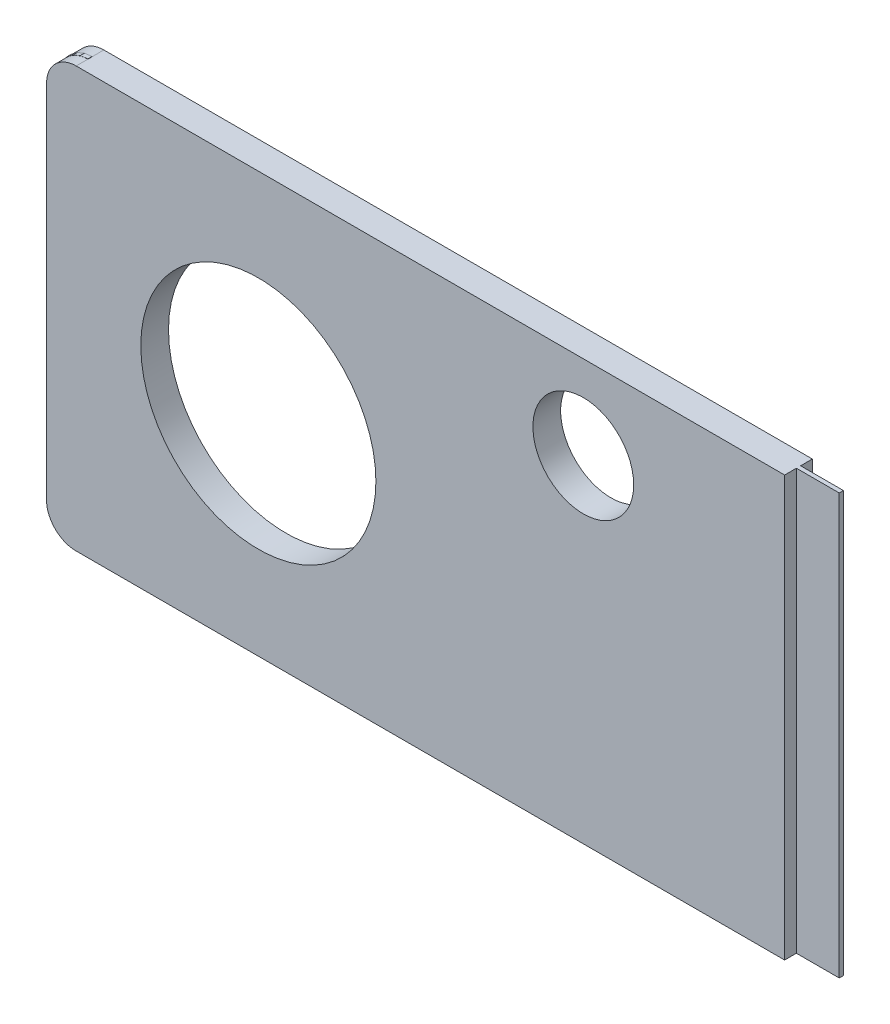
ISO-10303-21;
HEADER;
FILE_DESCRIPTION(('STEP AP214'),'2;1');
FILE_NAME('part.step','',(''),(''),'','','');
FILE_SCHEMA(('AUTOMOTIVE_DESIGN { 1 0 10303 214 1 1 1 1 }'));
ENDSEC;
DATA;
#1=APPLICATION_CONTEXT('core data for automotive mechanical design processes');
#2=APPLICATION_PROTOCOL_DEFINITION('international standard','automotive_design',2000,#1);
#3=PRODUCT_CONTEXT('',#1,'mechanical');
#4=PRODUCT('Part','Part','',(#3));
#5=PRODUCT_RELATED_PRODUCT_CATEGORY('part','',(#4));
#6=PRODUCT_DEFINITION_FORMATION('','',#4);
#7=PRODUCT_DEFINITION_CONTEXT('part definition',#1,'design');
#8=PRODUCT_DEFINITION('design','',#6,#7);
#9=PRODUCT_DEFINITION_SHAPE('','',#8);
#10=(LENGTH_UNIT() NAMED_UNIT(*) SI_UNIT(.MILLI.,.METRE.));
#11=(NAMED_UNIT(*) PLANE_ANGLE_UNIT() SI_UNIT($,.RADIAN.));
#12=(NAMED_UNIT(*) SI_UNIT($,.STERADIAN.) SOLID_ANGLE_UNIT());
#13=UNCERTAINTY_MEASURE_WITH_UNIT(LENGTH_MEASURE(1.E-05),#10,'distance_accuracy_value','');
#14=(GEOMETRIC_REPRESENTATION_CONTEXT(3) GLOBAL_UNCERTAINTY_ASSIGNED_CONTEXT((#13)) GLOBAL_UNIT_ASSIGNED_CONTEXT((#10,
#11,#12)) REPRESENTATION_CONTEXT('',''));
#15=CARTESIAN_POINT('',(0.,0.,0.));
#16=DIRECTION('',(0.,0.,1.));
#17=DIRECTION('',(1.,0.,0.));
#18=AXIS2_PLACEMENT_3D('',#15,#16,#17);
#19=CARTESIAN_POINT('',(0.,0.,0.391160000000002));
#20=DIRECTION('',(0.,0.,1.));
#21=DIRECTION('',(1.,0.,0.));
#22=AXIS2_PLACEMENT_3D('',#19,#20,#21);
#23=PLANE('',#22);
#24=DIRECTION('',(1.,0.,0.));
#25=VECTOR('',#24,1.);
#26=CARTESIAN_POINT('',(156.337000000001,251.477947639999,0.39115999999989));
#27=LINE('',#26,#25);
#28=CARTESIAN_POINT('',(177.794875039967,251.47794764,0.391159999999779));
#29=VERTEX_POINT('',#28);
#30=CARTESIAN_POINT('',(179.090275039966,251.477947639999,0.391159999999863));
#31=VERTEX_POINT('',#30);
#32=EDGE_CURVE('E459',#29,#31,#27,.T.);
#33=ORIENTED_EDGE('',*,*,#32,.T.);
#34=DIRECTION('',(0.,1.,0.));
#35=VECTOR('',#34,1.);
#36=CARTESIAN_POINT('',(179.090275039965,0.,0.391159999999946));
#37=LINE('',#36,#35);
#38=CARTESIAN_POINT('',(179.090275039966,264.185400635,0.391159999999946));
#39=VERTEX_POINT('',#38);
#40=EDGE_CURVE('E104',#31,#39,#37,.T.);
#41=ORIENTED_EDGE('',*,*,#40,.T.);
#42=DIRECTION('',(-1.,0.,0.));
#43=VECTOR('',#42,1.);
#44=CARTESIAN_POINT('',(271.018000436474,264.185400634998,0.39115999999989));
#45=LINE('',#44,#43);
#46=CARTESIAN_POINT('',(177.794875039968,264.185402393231,0.391159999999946));
#47=VERTEX_POINT('',#46);
#48=EDGE_CURVE('E462',#39,#47,#45,.T.);
#49=ORIENTED_EDGE('',*,*,#48,.T.);
#50=DIRECTION('',(0.,-1.,0.));
#51=VECTOR('',#50,1.);
#52=CARTESIAN_POINT('',(177.794875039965,-8.88178419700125E-13,0.391160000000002));
#53=LINE('',#52,#51);
#54=EDGE_CURVE('E387',#47,#29,#53,.T.);
#55=ORIENTED_EDGE('',*,*,#54,.T.);
#56=EDGE_LOOP('',(#33,#41,#49,#55));
#57=FACE_BOUND('',#56,.T.);
#58=ADVANCED_FACE('F89',(#57),#23,.T.);
#59=CARTESIAN_POINT('',(0.,0.,0.264159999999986));
#60=DIRECTION('',(0.,0.,1.));
#61=DIRECTION('',(1.,0.,0.));
#62=AXIS2_PLACEMENT_3D('',#59,#60,#61);
#63=PLANE('',#62);
#64=DIRECTION('',(0.,1.,0.));
#65=VECTOR('',#64,1.);
#66=CARTESIAN_POINT('',(179.090275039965,0.,0.26415999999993));
#67=LINE('',#66,#65);
#68=CARTESIAN_POINT('',(179.090275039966,251.477947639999,0.264159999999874));
#69=VERTEX_POINT('',#68);
#70=CARTESIAN_POINT('',(179.090275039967,264.185400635,0.264159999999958));
#71=VERTEX_POINT('',#70);
#72=EDGE_CURVE('E824',#69,#71,#67,.T.);
#73=ORIENTED_EDGE('',*,*,#72,.F.);
#74=DIRECTION('',(1.,0.,0.));
#75=VECTOR('',#74,1.);
#76=CARTESIAN_POINT('',(156.337000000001,251.477947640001,0.264159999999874));
#77=LINE('',#76,#75);
#78=CARTESIAN_POINT('',(177.794875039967,251.47794764,0.264159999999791));
#79=VERTEX_POINT('',#78);
#80=EDGE_CURVE('E408',#79,#69,#77,.T.);
#81=ORIENTED_EDGE('',*,*,#80,.F.);
#82=DIRECTION('',(0.,-1.,0.));
#83=VECTOR('',#82,1.);
#84=CARTESIAN_POINT('',(177.794875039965,-8.88178419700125E-13,0.264159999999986));
#85=LINE('',#84,#83);
#86=CARTESIAN_POINT('',(177.794875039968,264.185402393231,0.26415999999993));
#87=VERTEX_POINT('',#86);
#88=EDGE_CURVE('E539',#87,#79,#85,.T.);
#89=ORIENTED_EDGE('',*,*,#88,.F.);
#90=DIRECTION('',(-1.,0.,0.));
#91=VECTOR('',#90,1.);
#92=CARTESIAN_POINT('',(271.018000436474,264.185400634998,0.264159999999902));
#93=LINE('',#92,#91);
#94=EDGE_CURVE('E411',#71,#87,#93,.T.);
#95=ORIENTED_EDGE('',*,*,#94,.F.);
#96=EDGE_LOOP('',(#73,#81,#89,#95));
#97=FACE_BOUND('',#96,.T.);
#98=ADVANCED_FACE('F574',(#97),#63,.F.);
#99=CARTESIAN_POINT('',(271.018000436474,264.185400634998,0.264159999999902));
#100=DIRECTION('',(0.,1.,0.));
#101=DIRECTION('',(-1.,0.,0.));
#102=AXIS2_PLACEMENT_3D('',#99,#100,#101);
#103=PLANE('',#102);
#104=ORIENTED_EDGE('',*,*,#48,.F.);
#105=DIRECTION('',(0.,0.,-1.));
#106=VECTOR('',#105,1.);
#107=CARTESIAN_POINT('',(179.090275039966,264.185400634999,0.264159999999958));
#108=LINE('',#107,#106);
#109=EDGE_CURVE('E793',#39,#71,#108,.T.);
#110=ORIENTED_EDGE('',*,*,#109,.T.);
#111=ORIENTED_EDGE('',*,*,#94,.T.);
#112=DIRECTION('',(0.,0.,1.));
#113=VECTOR('',#112,1.);
#114=CARTESIAN_POINT('',(177.794875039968,264.185402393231,-0.0914400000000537));
#115=LINE('',#114,#113);
#116=CARTESIAN_POINT('',(177.794875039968,264.185402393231,-0.0914400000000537));
#117=VERTEX_POINT('',#116);
#118=EDGE_CURVE('E362',#117,#87,#115,.T.);
#119=ORIENTED_EDGE('',*,*,#118,.F.);
#120=DIRECTION('',(-0.999999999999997,-8.20358669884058E-08,0.));
#121=VECTOR('',#120,1.);
#122=CARTESIAN_POINT('',(-2.16726778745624E-05,264.185387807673,-0.0914400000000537));
#123=LINE('',#122,#121);
#124=CARTESIAN_POINT('',(156.362400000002,264.185400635,-0.0914400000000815));
#125=VERTEX_POINT('',#124);
#126=EDGE_CURVE('E672',#117,#125,#123,.T.);
#127=ORIENTED_EDGE('',*,*,#126,.T.);
#128=DIRECTION('',(0.,0.,1.));
#129=VECTOR('',#128,1.);
#130=CARTESIAN_POINT('',(156.362400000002,264.185400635,-0.0914400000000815));
#131=LINE('',#130,#129);
#132=CARTESIAN_POINT('',(156.362400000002,264.185400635,0.264159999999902));
#133=VERTEX_POINT('',#132);
#134=EDGE_CURVE('E351',#125,#133,#131,.T.);
#135=ORIENTED_EDGE('',*,*,#134,.T.);
#136=DIRECTION('',(0.,0.,1.));
#137=VECTOR('',#136,1.);
#138=CARTESIAN_POINT('',(156.362400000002,264.185400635,0.264159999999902));
#139=LINE('',#138,#137);
#140=CARTESIAN_POINT('',(156.362400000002,264.185400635,0.391159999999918));
#141=VERTEX_POINT('',#140);
#142=EDGE_CURVE('E528',#133,#141,#139,.T.);
#143=ORIENTED_EDGE('',*,*,#142,.T.);
#144=CARTESIAN_POINT('',(156.362400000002,264.185400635,0.746759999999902));
#145=VERTEX_POINT('',#144);
#146=EDGE_CURVE('E356',#141,#145,#131,.T.);
#147=ORIENTED_EDGE('',*,*,#146,.T.);
#148=DIRECTION('',(-0.999999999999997,-8.20358669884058E-08,0.));
#149=VECTOR('',#148,1.);
#150=CARTESIAN_POINT('',(-2.16726778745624E-05,264.185387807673,0.746759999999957));
#151=LINE('',#150,#149);
#152=CARTESIAN_POINT('',(177.794875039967,264.185402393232,0.74675999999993));
#153=VERTEX_POINT('',#152);
#154=EDGE_CURVE('E804',#153,#145,#151,.T.);
#155=ORIENTED_EDGE('',*,*,#154,.F.);
#156=EDGE_CURVE('E365',#47,#153,#115,.T.);
#157=ORIENTED_EDGE('',*,*,#156,.F.);
#158=EDGE_LOOP('',(#104,#110,#111,#119,#127,#135,#143,#147,#155,#157));
#159=FACE_BOUND('',#158,.T.);
#160=ADVANCED_FACE('F589',(#159),#103,.T.);
#161=CARTESIAN_POINT('',(156.337000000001,251.477947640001,0.264159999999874));
#162=DIRECTION('',(0.,-1.,0.));
#163=DIRECTION('',(0.,0.,-1.));
#164=AXIS2_PLACEMENT_3D('',#161,#162,#163);
#165=PLANE('',#164);
#166=ORIENTED_EDGE('',*,*,#80,.T.);
#167=DIRECTION('',(0.,0.,1.));
#168=VECTOR('',#167,1.);
#169=CARTESIAN_POINT('',(179.090275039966,251.477947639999,0.264159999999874));
#170=LINE('',#169,#168);
#171=EDGE_CURVE('E13',#69,#31,#170,.T.);
#172=ORIENTED_EDGE('',*,*,#171,.T.);
#173=ORIENTED_EDGE('',*,*,#32,.F.);
#174=DIRECTION('',(0.,0.,1.));
#175=VECTOR('',#174,1.);
#176=CARTESIAN_POINT('',(177.794875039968,251.477947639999,-0.0914400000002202));
#177=LINE('',#176,#175);
#178=CARTESIAN_POINT('',(177.794875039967,251.47794764,0.746759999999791));
#179=VERTEX_POINT('',#178);
#180=EDGE_CURVE('E368',#29,#179,#177,.T.);
#181=ORIENTED_EDGE('',*,*,#180,.T.);
#182=DIRECTION('',(-1.,0.,0.));
#183=VECTOR('',#182,1.);
#184=CARTESIAN_POINT('',(-8.88178419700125E-13,251.47794764,0.746759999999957));
#185=LINE('',#184,#183);
#186=CARTESIAN_POINT('',(156.337000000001,251.477947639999,0.746759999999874));
#187=VERTEX_POINT('',#186);
#188=EDGE_CURVE('E798',#179,#187,#185,.T.);
#189=ORIENTED_EDGE('',*,*,#188,.T.);
#190=DIRECTION('',(0.,0.,1.));
#191=VECTOR('',#190,1.);
#192=CARTESIAN_POINT('',(156.337000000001,251.477947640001,0.264159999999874));
#193=LINE('',#192,#191);
#194=CARTESIAN_POINT('',(156.337000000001,251.477947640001,-0.0914400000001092));
#195=VERTEX_POINT('',#194);
#196=EDGE_CURVE('E531',#195,#187,#193,.T.);
#197=ORIENTED_EDGE('',*,*,#196,.F.);
#198=DIRECTION('',(-1.,0.,0.));
#199=VECTOR('',#198,1.);
#200=CARTESIAN_POINT('',(-8.88178419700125E-13,251.47794764,-0.0914400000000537));
#201=LINE('',#200,#199);
#202=CARTESIAN_POINT('',(177.794875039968,251.477947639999,-0.0914400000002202));
#203=VERTEX_POINT('',#202);
#204=EDGE_CURVE('E662',#203,#195,#201,.T.);
#205=ORIENTED_EDGE('',*,*,#204,.F.);
#206=EDGE_CURVE('E366',#203,#79,#177,.T.);
#207=ORIENTED_EDGE('',*,*,#206,.T.);
#208=EDGE_LOOP('',(#166,#172,#173,#181,#189,#197,#205,#207));
#209=FACE_BOUND('',#208,.T.);
#210=ADVANCED_FACE('F708',(#209),#165,.T.);
#211=DIRECTION('',(0.,-1.,0.));
#212=VECTOR('',#211,1.);
#213=CARTESIAN_POINT('',(155.468275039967,0.,0.264160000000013));
#214=LINE('',#213,#212);
#215=CARTESIAN_POINT('',(155.468275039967,263.315739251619,0.264159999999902));
#216=VERTEX_POINT('',#215);
#217=CARTESIAN_POINT('',(155.468275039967,263.31369636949,0.264159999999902));
#218=VERTEX_POINT('',#217);
#219=EDGE_CURVE('E827',#216,#218,#214,.T.);
#220=ORIENTED_EDGE('',*,*,#219,.F.);
#221=DIRECTION('',(-0.130527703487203,-0.991444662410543,0.));
#222=VECTOR('',#221,1.);
#223=CARTESIAN_POINT('',(155.496282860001,263.528477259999,0.264159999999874));
#224=LINE('',#223,#222);
#225=CARTESIAN_POINT('',(155.468364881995,263.31642166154,0.264159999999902));
#226=VERTEX_POINT('',#225);
#227=EDGE_CURVE('E433',#226,#216,#224,.T.);
#228=ORIENTED_EDGE('',*,*,#227,.F.);
#229=CARTESIAN_POINT('',(156.367842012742,263.285405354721,0.264159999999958));
#230=DIRECTION('',(0.,0.,1.));
#231=DIRECTION('',(1.,0.,0.));
#232=AXIS2_PLACEMENT_3D('',#229,#230,#231);
#233=CIRCLE('',#232,0.900011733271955);
#234=EDGE_CURVE('E97',#218,#226,#233,.F.);
#235=ORIENTED_EDGE('',*,*,#234,.F.);
#236=EDGE_LOOP('',(#220,#228,#235));
#237=FACE_BOUND('',#236,.T.);
#238=ADVANCED_FACE('F591',(#237),#63,.F.);
#239=CARTESIAN_POINT('',(155.496282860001,263.528477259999,0.264159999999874));
#240=DIRECTION('',(-0.991444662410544,0.130527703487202,0.));
#241=DIRECTION('',(-0.130527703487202,-0.991444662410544,0.));
#242=AXIS2_PLACEMENT_3D('',#239,#240,#241);
#243=PLANE('',#242);
#244=ORIENTED_EDGE('',*,*,#227,.T.);
#245=DIRECTION('',(0.,0.,1.));
#246=VECTOR('',#245,1.);
#247=CARTESIAN_POINT('',(155.468275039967,263.315739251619,0.264159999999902));
#248=LINE('',#247,#246);
#249=CARTESIAN_POINT('',(155.468275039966,263.31573925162,0.391159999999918));
#250=VERTEX_POINT('',#249);
#251=EDGE_CURVE('E331',#216,#250,#248,.T.);
#252=ORIENTED_EDGE('',*,*,#251,.T.);
#253=DIRECTION('',(-0.130527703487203,-0.991444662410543,0.));
#254=VECTOR('',#253,1.);
#255=CARTESIAN_POINT('',(155.496282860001,263.528477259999,0.39115999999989));
#256=LINE('',#255,#254);
#257=CARTESIAN_POINT('',(155.468364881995,263.31642166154,0.391159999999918));
#258=VERTEX_POINT('',#257);
#259=EDGE_CURVE('E327',#258,#250,#256,.T.);
#260=ORIENTED_EDGE('',*,*,#259,.F.);
#261=DIRECTION('',(0.,0.,1.));
#262=VECTOR('',#261,1.);
#263=CARTESIAN_POINT('',(155.468364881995,263.31642166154,-0.0914400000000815));
#264=LINE('',#263,#262);
#265=EDGE_CURVE('E342',#258,#226,#264,.F.);
#266=ORIENTED_EDGE('',*,*,#265,.T.);
#267=EDGE_LOOP('',(#244,#252,#260,#266));
#268=FACE_BOUND('',#267,.T.);
#269=ADVANCED_FACE('F577',(#268),#243,.T.);
#270=ORIENTED_EDGE('',*,*,#259,.T.);
#271=DIRECTION('',(0.,-1.,0.));
#272=VECTOR('',#271,1.);
#273=CARTESIAN_POINT('',(155.468275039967,0.,0.391160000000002));
#274=LINE('',#273,#272);
#275=CARTESIAN_POINT('',(155.468275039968,263.313696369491,0.391159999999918));
#276=VERTEX_POINT('',#275);
#277=EDGE_CURVE('E325',#250,#276,#274,.T.);
#278=ORIENTED_EDGE('',*,*,#277,.T.);
#279=CARTESIAN_POINT('',(156.367842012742,263.285405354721,0.391159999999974));
#280=DIRECTION('',(0.,0.,1.));
#281=DIRECTION('',(1.,0.,0.));
#282=AXIS2_PLACEMENT_3D('',#279,#280,#281);
#283=CIRCLE('',#282,0.900011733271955);
#284=EDGE_CURVE('E111',#276,#258,#283,.F.);
#285=ORIENTED_EDGE('',*,*,#284,.T.);
#286=EDGE_LOOP('',(#270,#278,#285));
#287=FACE_BOUND('',#286,.T.);
#288=ADVANCED_FACE('F326',(#287),#23,.T.);
#289=DIRECTION('',(-0.382683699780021,-0.92387942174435,0.));
#290=VECTOR('',#289,1.);
#291=CARTESIAN_POINT('',(155.58586104,263.744737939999,0.391159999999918));
#292=LINE('',#291,#290);
#293=CARTESIAN_POINT('',(155.58586104,263.744737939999,0.391159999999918));
#294=VERTEX_POINT('',#293);
#295=CARTESIAN_POINT('',(155.559610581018,263.681363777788,0.391159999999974));
#296=VERTEX_POINT('',#295);
#297=EDGE_CURVE('E481',#294,#296,#292,.T.);
#298=ORIENTED_EDGE('',*,*,#297,.T.);
#299=CARTESIAN_POINT('',(155.653811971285,263.833294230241,0.391159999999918));
#300=VERTEX_POINT('',#299);
#301=EDGE_CURVE('E392',#296,#300,#283,.F.);
#302=ORIENTED_EDGE('',*,*,#301,.T.);
#303=DIRECTION('',(-0.608757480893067,-0.79335636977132,0.));
#304=VECTOR('',#303,1.);
#305=CARTESIAN_POINT('',(155.72835758,263.930444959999,0.391159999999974));
#306=LINE('',#305,#304);
#307=EDGE_CURVE('E476',#300,#294,#306,.T.);
#308=ORIENTED_EDGE('',*,*,#307,.T.);
#309=EDGE_LOOP('',(#298,#302,#308));
#310=FACE_BOUND('',#309,.T.);
#311=ADVANCED_FACE('F566',(#310),#23,.T.);
#312=CARTESIAN_POINT('',(155.72835758,263.930444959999,0.391159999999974));
#313=VERTEX_POINT('',#312);
#314=EDGE_CURVE('E477',#313,#300,#306,.T.);
#315=ORIENTED_EDGE('',*,*,#314,.T.);
#316=EDGE_CURVE('E343',#300,#141,#283,.F.);
#317=ORIENTED_EDGE('',*,*,#316,.T.);
#318=DIRECTION('',(0.,1.,0.));
#319=VECTOR('',#318,1.);
#320=CARTESIAN_POINT('',(156.362400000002,264.185400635,0.391159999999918));
#321=LINE('',#320,#319);
#322=CARTESIAN_POINT('',(156.3624,264.19307334,0.391159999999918));
#323=VERTEX_POINT('',#322);
#324=EDGE_CURVE('E464',#141,#323,#321,.T.);
#325=ORIENTED_EDGE('',*,*,#324,.T.);
#326=DIRECTION('',(-0.991444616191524,-0.130528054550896,0.));
#327=VECTOR('',#326,1.);
#328=CARTESIAN_POINT('',(156.3624,264.19307334,0.391159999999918));
#329=LINE('',#328,#327);
#330=CARTESIAN_POINT('',(156.130325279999,264.16251968,0.391159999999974));
#331=VERTEX_POINT('',#330);
#332=EDGE_CURVE('E467',#323,#331,#329,.T.);
#333=ORIENTED_EDGE('',*,*,#332,.T.);
#334=DIRECTION('',(-0.923879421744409,-0.382683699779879,0.));
#335=VECTOR('',#334,1.);
#336=CARTESIAN_POINT('',(156.130325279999,264.16251968,0.391159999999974));
#337=LINE('',#336,#335);
#338=CARTESIAN_POINT('',(155.914064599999,264.072941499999,0.391160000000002));
#339=VERTEX_POINT('',#338);
#340=EDGE_CURVE('E470',#331,#339,#337,.T.);
#341=ORIENTED_EDGE('',*,*,#340,.T.);
#342=DIRECTION('',(-0.793356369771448,-0.6087574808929,0.));
#343=VECTOR('',#342,1.);
#344=CARTESIAN_POINT('',(155.914064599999,264.072941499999,0.391160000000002));
#345=LINE('',#344,#343);
#346=EDGE_CURVE('E473',#339,#313,#345,.T.);
#347=ORIENTED_EDGE('',*,*,#346,.T.);
#348=EDGE_LOOP('',(#315,#317,#325,#333,#341,#347));
#349=FACE_BOUND('',#348,.T.);
#350=ADVANCED_FACE('F581',(#349),#23,.T.);
#351=CARTESIAN_POINT('',(155.58586104,263.744737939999,0.264159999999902));
#352=DIRECTION('',(-0.92387942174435,0.382683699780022,0.));
#353=DIRECTION('',(-0.382683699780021,-0.92387942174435,0.));
#354=AXIS2_PLACEMENT_3D('',#351,#352,#353);
#355=PLANE('',#354);
#356=DIRECTION('',(-0.382683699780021,-0.92387942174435,0.));
#357=VECTOR('',#356,1.);
#358=CARTESIAN_POINT('',(155.58586104,263.744737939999,0.264159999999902));
#359=LINE('',#358,#357);
#360=CARTESIAN_POINT('',(155.58586104,263.744737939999,0.264159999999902));
#361=VERTEX_POINT('',#360);
#362=CARTESIAN_POINT('',(155.559610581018,263.681363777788,0.264159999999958));
#363=VERTEX_POINT('',#362);
#364=EDGE_CURVE('E430',#361,#363,#359,.T.);
#365=ORIENTED_EDGE('',*,*,#364,.T.);
#366=DIRECTION('',(0.,0.,1.));
#367=VECTOR('',#366,1.);
#368=CARTESIAN_POINT('',(155.559610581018,263.681363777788,-0.0914400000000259));
#369=LINE('',#368,#367);
#370=EDGE_CURVE('E390',#363,#296,#369,.T.);
#371=ORIENTED_EDGE('',*,*,#370,.T.);
#372=ORIENTED_EDGE('',*,*,#297,.F.);
#373=DIRECTION('',(0.,0.,1.));
#374=VECTOR('',#373,1.);
#375=CARTESIAN_POINT('',(155.58586104,263.744737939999,0.264159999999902));
#376=LINE('',#375,#374);
#377=EDGE_CURVE('E517',#361,#294,#376,.T.);
#378=ORIENTED_EDGE('',*,*,#377,.F.);
#379=EDGE_LOOP('',(#365,#371,#372,#378));
#380=FACE_BOUND('',#379,.T.);
#381=ADVANCED_FACE('F732',(#380),#355,.T.);
#382=CARTESIAN_POINT('',(155.653811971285,263.833294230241,0.264159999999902));
#383=VERTEX_POINT('',#382);
#384=EDGE_CURVE('E542',#363,#383,#233,.F.);
#385=ORIENTED_EDGE('',*,*,#384,.F.);
#386=ORIENTED_EDGE('',*,*,#364,.F.);
#387=DIRECTION('',(-0.608757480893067,-0.79335636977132,0.));
#388=VECTOR('',#387,1.);
#389=CARTESIAN_POINT('',(155.72835758,263.930444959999,0.264159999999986));
#390=LINE('',#389,#388);
#391=EDGE_CURVE('E425',#383,#361,#390,.T.);
#392=ORIENTED_EDGE('',*,*,#391,.F.);
#393=EDGE_LOOP('',(#385,#386,#392));
#394=FACE_BOUND('',#393,.T.);
#395=ADVANCED_FACE('F781',(#394),#63,.F.);
#396=EDGE_CURVE('E541',#383,#133,#233,.F.);
#397=ORIENTED_EDGE('',*,*,#396,.F.);
#398=CARTESIAN_POINT('',(155.72835758,263.930444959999,0.264159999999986));
#399=VERTEX_POINT('',#398);
#400=EDGE_CURVE('E426',#399,#383,#390,.T.);
#401=ORIENTED_EDGE('',*,*,#400,.F.);
#402=DIRECTION('',(-0.793356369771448,-0.6087574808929,0.));
#403=VECTOR('',#402,1.);
#404=CARTESIAN_POINT('',(155.914064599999,264.072941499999,0.264159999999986));
#405=LINE('',#404,#403);
#406=CARTESIAN_POINT('',(155.914064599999,264.072941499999,0.264159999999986));
#407=VERTEX_POINT('',#406);
#408=EDGE_CURVE('E422',#407,#399,#405,.T.);
#409=ORIENTED_EDGE('',*,*,#408,.F.);
#410=DIRECTION('',(-0.923879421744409,-0.382683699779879,0.));
#411=VECTOR('',#410,1.);
#412=CARTESIAN_POINT('',(156.130325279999,264.16251968,0.264159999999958));
#413=LINE('',#412,#411);
#414=CARTESIAN_POINT('',(156.130325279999,264.16251968,0.264159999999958));
#415=VERTEX_POINT('',#414);
#416=EDGE_CURVE('E419',#415,#407,#413,.T.);
#417=ORIENTED_EDGE('',*,*,#416,.F.);
#418=DIRECTION('',(-0.991444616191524,-0.130528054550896,0.));
#419=VECTOR('',#418,1.);
#420=CARTESIAN_POINT('',(156.3624,264.19307334,0.264159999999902));
#421=LINE('',#420,#419);
#422=CARTESIAN_POINT('',(156.3624,264.19307334,0.264159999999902));
#423=VERTEX_POINT('',#422);
#424=EDGE_CURVE('E416',#423,#415,#421,.T.);
#425=ORIENTED_EDGE('',*,*,#424,.F.);
#426=DIRECTION('',(0.,1.,0.));
#427=VECTOR('',#426,1.);
#428=CARTESIAN_POINT('',(156.362400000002,264.185400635,0.264159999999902));
#429=LINE('',#428,#427);
#430=EDGE_CURVE('E413',#133,#423,#429,.T.);
#431=ORIENTED_EDGE('',*,*,#430,.F.);
#432=EDGE_LOOP('',(#397,#401,#409,#417,#425,#431));
#433=FACE_BOUND('',#432,.T.);
#434=ADVANCED_FACE('F685',(#433),#63,.F.);
#435=CARTESIAN_POINT('',(155.72835758,263.930444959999,0.264159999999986));
#436=DIRECTION('',(-0.79335636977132,0.608757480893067,0.));
#437=DIRECTION('',(-0.608757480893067,-0.79335636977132,0.));
#438=AXIS2_PLACEMENT_3D('',#435,#436,#437);
#439=PLANE('',#438);
#440=ORIENTED_EDGE('',*,*,#400,.T.);
#441=ORIENTED_EDGE('',*,*,#391,.T.);
#442=ORIENTED_EDGE('',*,*,#377,.T.);
#443=ORIENTED_EDGE('',*,*,#307,.F.);
#444=ORIENTED_EDGE('',*,*,#314,.F.);
#445=DIRECTION('',(0.,0.,1.));
#446=VECTOR('',#445,1.);
#447=CARTESIAN_POINT('',(155.72835758,263.930444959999,0.264159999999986));
#448=LINE('',#447,#446);
#449=EDGE_CURVE('E520',#399,#313,#448,.T.);
#450=ORIENTED_EDGE('',*,*,#449,.F.);
#451=EDGE_LOOP('',(#440,#441,#442,#443,#444,#450));
#452=FACE_BOUND('',#451,.T.);
#453=ADVANCED_FACE('F726',(#452),#439,.T.);
#454=CARTESIAN_POINT('',(155.914064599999,264.072941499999,0.264159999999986));
#455=DIRECTION('',(-0.6087574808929,0.793356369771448,0.));
#456=DIRECTION('',(-0.793356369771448,-0.6087574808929,0.));
#457=AXIS2_PLACEMENT_3D('',#454,#455,#456);
#458=PLANE('',#457);
#459=ORIENTED_EDGE('',*,*,#346,.F.);
#460=DIRECTION('',(0.,0.,1.));
#461=VECTOR('',#460,1.);
#462=CARTESIAN_POINT('',(155.914064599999,264.072941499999,0.264159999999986));
#463=LINE('',#462,#461);
#464=EDGE_CURVE('E522',#407,#339,#463,.T.);
#465=ORIENTED_EDGE('',*,*,#464,.F.);
#466=ORIENTED_EDGE('',*,*,#408,.T.);
#467=ORIENTED_EDGE('',*,*,#449,.T.);
#468=EDGE_LOOP('',(#459,#465,#466,#467));
#469=FACE_BOUND('',#468,.T.);
#470=ADVANCED_FACE('F722',(#469),#458,.T.);
#471=CARTESIAN_POINT('',(156.130325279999,264.16251968,0.264159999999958));
#472=DIRECTION('',(-0.382683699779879,0.92387942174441,0.));
#473=DIRECTION('',(-0.92387942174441,-0.382683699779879,0.));
#474=AXIS2_PLACEMENT_3D('',#471,#472,#473);
#475=PLANE('',#474);
#476=ORIENTED_EDGE('',*,*,#340,.F.);
#477=DIRECTION('',(0.,0.,1.));
#478=VECTOR('',#477,1.);
#479=CARTESIAN_POINT('',(156.130325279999,264.16251968,0.264159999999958));
#480=LINE('',#479,#478);
#481=EDGE_CURVE('E524',#415,#331,#480,.T.);
#482=ORIENTED_EDGE('',*,*,#481,.F.);
#483=ORIENTED_EDGE('',*,*,#416,.T.);
#484=ORIENTED_EDGE('',*,*,#464,.T.);
#485=EDGE_LOOP('',(#476,#482,#483,#484));
#486=FACE_BOUND('',#485,.T.);
#487=ADVANCED_FACE('F719',(#486),#475,.T.);
#488=CARTESIAN_POINT('',(156.3624,264.19307334,0.264159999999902));
#489=DIRECTION('',(-0.130528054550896,0.991444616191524,0.));
#490=DIRECTION('',(-0.991444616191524,-0.130528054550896,0.));
#491=AXIS2_PLACEMENT_3D('',#488,#489,#490);
#492=PLANE('',#491);
#493=ORIENTED_EDGE('',*,*,#332,.F.);
#494=DIRECTION('',(0.,0.,1.));
#495=VECTOR('',#494,1.);
#496=CARTESIAN_POINT('',(156.3624,264.19307334,0.264159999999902));
#497=LINE('',#496,#495);
#498=EDGE_CURVE('E526',#423,#323,#497,.T.);
#499=ORIENTED_EDGE('',*,*,#498,.F.);
#500=ORIENTED_EDGE('',*,*,#424,.T.);
#501=ORIENTED_EDGE('',*,*,#481,.T.);
#502=EDGE_LOOP('',(#493,#499,#500,#501));
#503=FACE_BOUND('',#502,.T.);
#504=ADVANCED_FACE('F692',(#503),#492,.T.);
#505=CARTESIAN_POINT('',(156.362400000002,264.185400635,0.264159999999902));
#506=DIRECTION('',(1.,0.,0.));
#507=DIRECTION('',(0.,0.,-1.));
#508=AXIS2_PLACEMENT_3D('',#505,#506,#507);
#509=PLANE('',#508);
#510=ORIENTED_EDGE('',*,*,#324,.F.);
#511=ORIENTED_EDGE('',*,*,#142,.F.);
#512=ORIENTED_EDGE('',*,*,#430,.T.);
#513=ORIENTED_EDGE('',*,*,#498,.T.);
#514=EDGE_LOOP('',(#510,#511,#512,#513));
#515=FACE_BOUND('',#514,.T.);
#516=ADVANCED_FACE('F682',(#515),#509,.T.);
#517=CARTESIAN_POINT('',(177.794875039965,-8.88178419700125E-13,-0.0914399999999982));
#518=DIRECTION('',(-1.,0.,0.));
#519=DIRECTION('',(0.,0.,1.));
#520=AXIS2_PLACEMENT_3D('',#517,#518,#519);
#521=PLANE('',#520);
#522=ORIENTED_EDGE('',*,*,#118,.T.);
#523=ORIENTED_EDGE('',*,*,#88,.T.);
#524=ORIENTED_EDGE('',*,*,#206,.F.);
#525=DIRECTION('',(0.,-1.,0.));
#526=VECTOR('',#525,1.);
#527=CARTESIAN_POINT('',(177.794875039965,-8.88178419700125E-13,-0.0914399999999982));
#528=LINE('',#527,#526);
#529=EDGE_CURVE('E665',#117,#203,#528,.T.);
#530=ORIENTED_EDGE('',*,*,#529,.F.);
#531=EDGE_LOOP('',(#522,#523,#524,#530));
#532=FACE_BOUND('',#531,.T.);
#533=ADVANCED_FACE('F716',(#532),#521,.F.);
#534=CARTESIAN_POINT('',(155.468275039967,0.,-0.0914399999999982));
#535=DIRECTION('',(-1.,0.,0.));
#536=DIRECTION('',(0.,0.,1.));
#537=AXIS2_PLACEMENT_3D('',#534,#535,#536);
#538=PLANE('',#537);
#539=ORIENTED_EDGE('',*,*,#219,.T.);
#540=DIRECTION('',(0.,0.,1.));
#541=VECTOR('',#540,1.);
#542=CARTESIAN_POINT('',(155.468275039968,263.313696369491,-0.0914400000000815));
#543=LINE('',#542,#541);
#544=CARTESIAN_POINT('',(155.468275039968,263.313696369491,-0.0914400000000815));
#545=VERTEX_POINT('',#544);
#546=EDGE_CURVE('E350',#545,#218,#543,.T.);
#547=ORIENTED_EDGE('',*,*,#546,.F.);
#548=DIRECTION('',(0.,-1.,0.));
#549=VECTOR('',#548,1.);
#550=CARTESIAN_POINT('',(155.468275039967,0.,-0.0914399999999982));
#551=LINE('',#550,#549);
#552=CARTESIAN_POINT('',(155.468275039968,252.300953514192,-0.0914400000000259));
#553=VERTEX_POINT('',#552);
#554=EDGE_CURVE('E663',#545,#553,#551,.T.);
#555=ORIENTED_EDGE('',*,*,#554,.T.);
#556=DIRECTION('',(0.,0.,1.));
#557=VECTOR('',#556,1.);
#558=CARTESIAN_POINT('',(155.468275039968,252.300953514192,-0.0914400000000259));
#559=LINE('',#558,#557);
#560=CARTESIAN_POINT('',(155.468275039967,252.300953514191,0.746759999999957));
#561=VERTEX_POINT('',#560);
#562=EDGE_CURVE('E369',#553,#561,#559,.T.);
#563=ORIENTED_EDGE('',*,*,#562,.T.);
#564=DIRECTION('',(0.,-1.,0.));
#565=VECTOR('',#564,1.);
#566=CARTESIAN_POINT('',(155.468275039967,0.,0.746760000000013));
#567=LINE('',#566,#565);
#568=CARTESIAN_POINT('',(155.468275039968,263.313696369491,0.746759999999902));
#569=VERTEX_POINT('',#568);
#570=EDGE_CURVE('E348',#569,#561,#567,.T.);
#571=ORIENTED_EDGE('',*,*,#570,.F.);
#572=EDGE_CURVE('E338',#276,#569,#543,.T.);
#573=ORIENTED_EDGE('',*,*,#572,.F.);
#574=ORIENTED_EDGE('',*,*,#277,.F.);
#575=ORIENTED_EDGE('',*,*,#251,.F.);
#576=EDGE_LOOP('',(#539,#547,#555,#563,#571,#573,#574,#575));
#577=FACE_BOUND('',#576,.T.);
#578=ADVANCED_FACE('F346',(#577),#538,.T.);
#579=CARTESIAN_POINT('',(156.367842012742,263.285405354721,-0.0914400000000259));
#580=DIRECTION('',(0.,0.,1.));
#581=DIRECTION('',(1.,0.,0.));
#582=AXIS2_PLACEMENT_3D('',#579,#580,#581);
#583=CYLINDRICAL_SURFACE('',#582,0.900011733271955);
#584=ORIENTED_EDGE('',*,*,#316,.F.);
#585=ORIENTED_EDGE('',*,*,#301,.F.);
#586=ORIENTED_EDGE('',*,*,#370,.F.);
#587=ORIENTED_EDGE('',*,*,#384,.T.);
#588=ORIENTED_EDGE('',*,*,#396,.T.);
#589=ORIENTED_EDGE('',*,*,#134,.F.);
#590=CARTESIAN_POINT('',(156.367842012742,263.285405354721,-0.0914400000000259));
#591=DIRECTION('',(0.,0.,1.));
#592=DIRECTION('',(1.,0.,0.));
#593=AXIS2_PLACEMENT_3D('',#590,#591,#592);
#594=CIRCLE('',#593,0.900011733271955);
#595=EDGE_CURVE('E359',#545,#125,#594,.F.);
#596=ORIENTED_EDGE('',*,*,#595,.F.);
#597=ORIENTED_EDGE('',*,*,#546,.T.);
#598=ORIENTED_EDGE('',*,*,#234,.T.);
#599=ORIENTED_EDGE('',*,*,#265,.F.);
#600=ORIENTED_EDGE('',*,*,#284,.F.);
#601=ORIENTED_EDGE('',*,*,#572,.T.);
#602=CARTESIAN_POINT('',(156.367842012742,263.285405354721,0.746759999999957));
#603=DIRECTION('',(0.,0.,1.));
#604=DIRECTION('',(1.,0.,0.));
#605=AXIS2_PLACEMENT_3D('',#602,#603,#604);
#606=CIRCLE('',#605,0.900011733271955);
#607=EDGE_CURVE('E807',#569,#145,#606,.F.);
#608=ORIENTED_EDGE('',*,*,#607,.T.);
#609=ORIENTED_EDGE('',*,*,#146,.F.);
#610=EDGE_LOOP('',(#584,#585,#586,#587,#588,#589,#596,#597,#598,#599,#600,#601,#608,#609));
#611=FACE_BOUND('',#610,.T.);
#612=CARTESIAN_POINT('',(155.490986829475,263.488250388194,0.39115999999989));
#613=VERTEX_POINT('',#612);
#614=CARTESIAN_POINT('',(155.516351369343,263.576926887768,0.391159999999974));
#615=VERTEX_POINT('',#614);
#616=EDGE_CURVE('E345',#613,#615,#283,.F.);
#617=ORIENTED_EDGE('',*,*,#616,.F.);
#618=DIRECTION('',(0.,0.,1.));
#619=VECTOR('',#618,1.);
#620=CARTESIAN_POINT('',(155.490986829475,263.488250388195,-0.0914400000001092));
#621=LINE('',#620,#619);
#622=CARTESIAN_POINT('',(155.490986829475,263.488250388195,0.264159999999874));
#623=VERTEX_POINT('',#622);
#624=EDGE_CURVE('E398',#623,#613,#621,.T.);
#625=ORIENTED_EDGE('',*,*,#624,.F.);
#626=CARTESIAN_POINT('',(155.516351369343,263.576926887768,0.264159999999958));
#627=VERTEX_POINT('',#626);
#628=EDGE_CURVE('E545',#623,#627,#233,.F.);
#629=ORIENTED_EDGE('',*,*,#628,.T.);
#630=DIRECTION('',(0.,0.,1.));
#631=VECTOR('',#630,1.);
#632=CARTESIAN_POINT('',(155.516351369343,263.576926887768,-0.0914400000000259));
#633=LINE('',#632,#631);
#634=EDGE_CURVE('E395',#615,#627,#633,.F.);
#635=ORIENTED_EDGE('',*,*,#634,.F.);
#636=EDGE_LOOP('',(#617,#625,#629,#635));
#637=FACE_BOUND('',#636,.T.);
#638=ADVANCED_FACE('F335',(#611,#637),#583,.T.);
#639=ORIENTED_EDGE('',*,*,#54,.F.);
#640=ORIENTED_EDGE('',*,*,#156,.T.);
#641=DIRECTION('',(0.,-1.,0.));
#642=VECTOR('',#641,1.);
#643=CARTESIAN_POINT('',(177.794875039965,-8.88178419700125E-13,0.746759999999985));
#644=LINE('',#643,#642);
#645=EDGE_CURVE('E801',#153,#179,#644,.T.);
#646=ORIENTED_EDGE('',*,*,#645,.T.);
#647=ORIENTED_EDGE('',*,*,#180,.F.);
#648=EDGE_LOOP('',(#639,#640,#646,#647));
#649=FACE_BOUND('',#648,.T.);
#650=ADVANCED_FACE('F648',(#649),#521,.F.);
#651=CARTESIAN_POINT('',(156.356036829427,252.368036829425,-0.0914400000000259));
#652=DIRECTION('',(0.,0.,1.));
#653=DIRECTION('',(1.,0.,0.));
#654=AXIS2_PLACEMENT_3D('',#651,#652,#653);
#655=CYLINDRICAL_SURFACE('',#654,0.890292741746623);
#656=DIRECTION('',(0.,0.,1.));
#657=VECTOR('',#656,1.);
#658=CARTESIAN_POINT('',(155.491348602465,252.15605702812,-0.0914400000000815));
#659=LINE('',#658,#657);
#660=CARTESIAN_POINT('',(155.491348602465,252.15605702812,0.264159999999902));
#661=VERTEX_POINT('',#660);
#662=CARTESIAN_POINT('',(155.491348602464,252.156057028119,0.391159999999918));
#663=VERTEX_POINT('',#662);
#664=EDGE_CURVE('E382',#661,#663,#659,.T.);
#665=ORIENTED_EDGE('',*,*,#664,.T.);
#666=CARTESIAN_POINT('',(156.356036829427,252.368036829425,0.391159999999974));
#667=DIRECTION('',(0.,0.,1.));
#668=DIRECTION('',(1.,0.,0.));
#669=AXIS2_PLACEMENT_3D('',#666,#667,#668);
#670=CIRCLE('',#669,0.890292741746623);
#671=CARTESIAN_POINT('',(155.513427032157,252.080582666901,0.391159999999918));
#672=VERTEX_POINT('',#671);
#673=EDGE_CURVE('E377',#663,#672,#670,.T.);
#674=ORIENTED_EDGE('',*,*,#673,.T.);
#675=DIRECTION('',(0.,0.,1.));
#676=VECTOR('',#675,1.);
#677=CARTESIAN_POINT('',(155.513427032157,252.080582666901,-0.0914400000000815));
#678=LINE('',#677,#676);
#679=CARTESIAN_POINT('',(155.513427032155,252.080582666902,0.264159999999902));
#680=VERTEX_POINT('',#679);
#681=EDGE_CURVE('E384',#672,#680,#678,.F.);
#682=ORIENTED_EDGE('',*,*,#681,.T.);
#683=CARTESIAN_POINT('',(156.356036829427,252.368036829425,0.264159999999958));
#684=DIRECTION('',(0.,0.,1.));
#685=DIRECTION('',(1.,0.,0.));
#686=AXIS2_PLACEMENT_3D('',#683,#684,#685);
#687=CIRCLE('',#686,0.890292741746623);
#688=EDGE_CURVE('E538',#661,#680,#687,.T.);
#689=ORIENTED_EDGE('',*,*,#688,.F.);
#690=EDGE_LOOP('',(#665,#674,#682,#689));
#691=FACE_BOUND('',#690,.T.);
#692=DIRECTION('',(0.,0.,1.));
#693=VECTOR('',#692,1.);
#694=CARTESIAN_POINT('',(155.556959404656,251.975485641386,-0.0914400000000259));
#695=LINE('',#694,#693);
#696=CARTESIAN_POINT('',(155.556959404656,251.975485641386,0.264159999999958));
#697=VERTEX_POINT('',#696);
#698=CARTESIAN_POINT('',(155.556959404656,251.975485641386,0.391159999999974));
#699=VERTEX_POINT('',#698);
#700=EDGE_CURVE('E376',#697,#699,#695,.T.);
#701=ORIENTED_EDGE('',*,*,#700,.T.);
#702=CARTESIAN_POINT('',(155.649721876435,251.826058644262,0.391159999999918));
#703=VERTEX_POINT('',#702);
#704=EDGE_CURVE('E385',#699,#703,#670,.T.);
#705=ORIENTED_EDGE('',*,*,#704,.T.);
#706=CARTESIAN_POINT('',(155.814058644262,251.661721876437,0.391159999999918));
#707=VERTEX_POINT('',#706);
#708=EDGE_CURVE('E620',#703,#707,#670,.T.);
#709=ORIENTED_EDGE('',*,*,#708,.T.);
#710=CARTESIAN_POINT('',(155.963485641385,251.568959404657,0.391159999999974));
#711=VERTEX_POINT('',#710);
#712=EDGE_CURVE('E378',#707,#711,#670,.T.);
#713=ORIENTED_EDGE('',*,*,#712,.T.);
#714=DIRECTION('',(0.,0.,1.));
#715=VECTOR('',#714,1.);
#716=CARTESIAN_POINT('',(155.963485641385,251.568959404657,-0.0914400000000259));
#717=LINE('',#716,#715);
#718=CARTESIAN_POINT('',(155.963485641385,251.568959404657,0.264159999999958));
#719=VERTEX_POINT('',#718);
#720=EDGE_CURVE('E380',#711,#719,#717,.F.);
#721=ORIENTED_EDGE('',*,*,#720,.T.);
#722=CARTESIAN_POINT('',(155.814058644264,251.661721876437,0.264159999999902));
#723=VERTEX_POINT('',#722);
#724=EDGE_CURVE('E537',#723,#719,#687,.T.);
#725=ORIENTED_EDGE('',*,*,#724,.F.);
#726=CARTESIAN_POINT('',(155.649721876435,251.826058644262,0.264159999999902));
#727=VERTEX_POINT('',#726);
#728=EDGE_CURVE('E635',#727,#723,#687,.T.);
#729=ORIENTED_EDGE('',*,*,#728,.F.);
#730=EDGE_CURVE('E638',#697,#727,#687,.T.);
#731=ORIENTED_EDGE('',*,*,#730,.F.);
#732=EDGE_LOOP('',(#701,#705,#709,#713,#721,#725,#729,#731));
#733=FACE_BOUND('',#732,.T.);
#734=DIRECTION('',(0.,0.,1.));
#735=VECTOR('',#734,1.);
#736=CARTESIAN_POINT('',(156.068582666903,251.525427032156,-0.0914400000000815));
#737=LINE('',#736,#735);
#738=CARTESIAN_POINT('',(156.068582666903,251.525427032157,0.264159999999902));
#739=VERTEX_POINT('',#738);
#740=CARTESIAN_POINT('',(156.068582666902,251.525427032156,0.391159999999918));
#741=VERTEX_POINT('',#740);
#742=EDGE_CURVE('E372',#739,#741,#737,.T.);
#743=ORIENTED_EDGE('',*,*,#742,.T.);
#744=CARTESIAN_POINT('',(156.144057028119,251.503348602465,0.391159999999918));
#745=VERTEX_POINT('',#744);
#746=EDGE_CURVE('E374',#741,#745,#670,.T.);
#747=ORIENTED_EDGE('',*,*,#746,.T.);
#748=DIRECTION('',(0.,0.,1.));
#749=VECTOR('',#748,1.);
#750=CARTESIAN_POINT('',(156.144057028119,251.503348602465,-0.0914400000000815));
#751=LINE('',#750,#749);
#752=CARTESIAN_POINT('',(156.144057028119,251.503348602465,0.264159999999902));
#753=VERTEX_POINT('',#752);
#754=EDGE_CURVE('E354',#745,#753,#751,.F.);
#755=ORIENTED_EDGE('',*,*,#754,.T.);
#756=EDGE_CURVE('E504',#739,#753,#687,.T.);
#757=ORIENTED_EDGE('',*,*,#756,.F.);
#758=EDGE_LOOP('',(#743,#747,#755,#757));
#759=FACE_BOUND('',#758,.T.);
#760=CARTESIAN_POINT('',(156.356036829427,252.368036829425,-0.0914400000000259));
#761=DIRECTION('',(0.,0.,1.));
#762=DIRECTION('',(1.,0.,0.));
#763=AXIS2_PLACEMENT_3D('',#760,#761,#762);
#764=CIRCLE('',#763,0.890292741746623);
#765=EDGE_CURVE('E655',#553,#195,#764,.T.);
#766=ORIENTED_EDGE('',*,*,#765,.T.);
#767=ORIENTED_EDGE('',*,*,#196,.T.);
#768=CARTESIAN_POINT('',(156.356036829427,252.368036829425,0.746759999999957));
#769=DIRECTION('',(0.,0.,1.));
#770=DIRECTION('',(1.,0.,0.));
#771=AXIS2_PLACEMENT_3D('',#768,#769,#770);
#772=CIRCLE('',#771,0.890292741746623);
#773=EDGE_CURVE('E790',#561,#187,#772,.T.);
#774=ORIENTED_EDGE('',*,*,#773,.F.);
#775=ORIENTED_EDGE('',*,*,#562,.F.);
#776=EDGE_LOOP('',(#766,#767,#774,#775));
#777=FACE_BOUND('',#776,.T.);
#778=ADVANCED_FACE('F642',(#691,#733,#759,#777),#655,.T.);
#779=CARTESIAN_POINT('',(0.,0.,-0.0914399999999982));
#780=DIRECTION('',(0.,0.,1.));
#781=DIRECTION('',(1.,0.,0.));
#782=AXIS2_PLACEMENT_3D('',#779,#780,#781);
#783=PLANE('',#782);
#784=CARTESIAN_POINT('',(161.874200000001,257.835399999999,-0.0914400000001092));
#785=DIRECTION('',(0.,0.,1.));
#786=DIRECTION('',(1.,0.,0.));
#787=AXIS2_PLACEMENT_3D('',#784,#785,#786);
#788=CIRCLE('',#787,3.55600000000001);
#789=CARTESIAN_POINT('',(165.430200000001,257.835399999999,-0.0914400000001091));
#790=VERTEX_POINT('',#789);
#791=EDGE_CURVE('E809',#790,#790,#788,.T.);
#792=ORIENTED_EDGE('',*,*,#791,.T.);
#793=EDGE_LOOP('',(#792));
#794=FACE_BOUND('',#793,.T.);
#795=CARTESIAN_POINT('',(171.704,261.6454,-0.0914399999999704));
#796=DIRECTION('',(0.,0.,1.));
#797=DIRECTION('',(1.,0.,0.));
#798=AXIS2_PLACEMENT_3D('',#795,#796,#797);
#799=CIRCLE('',#798,1.524);
#800=CARTESIAN_POINT('',(173.228,261.6454,-0.0914399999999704));
#801=VERTEX_POINT('',#800);
#802=EDGE_CURVE('E667',#801,#801,#799,.T.);
#803=ORIENTED_EDGE('',*,*,#802,.T.);
#804=EDGE_LOOP('',(#803));
#805=FACE_BOUND('',#804,.T.);
#806=ORIENTED_EDGE('',*,*,#554,.F.);
#807=ORIENTED_EDGE('',*,*,#595,.T.);
#808=ORIENTED_EDGE('',*,*,#126,.F.);
#809=ORIENTED_EDGE('',*,*,#529,.T.);
#810=ORIENTED_EDGE('',*,*,#204,.T.);
#811=ORIENTED_EDGE('',*,*,#765,.F.);
#812=EDGE_LOOP('',(#806,#807,#808,#809,#810,#811));
#813=FACE_BOUND('',#812,.T.);
#814=ADVANCED_FACE('F647',(#794,#805,#813),#783,.F.);
#815=CARTESIAN_POINT('',(0.,-8.88178419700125E-13,0.746760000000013));
#816=DIRECTION('',(0.,0.,1.));
#817=DIRECTION('',(1.,0.,0.));
#818=AXIS2_PLACEMENT_3D('',#815,#816,#817);
#819=PLANE('',#818);
#820=CARTESIAN_POINT('',(161.874199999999,257.8354,0.746759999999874));
#821=DIRECTION('',(0.,0.,1.));
#822=DIRECTION('',(1.,0.,0.));
#823=AXIS2_PLACEMENT_3D('',#820,#821,#822);
#824=CIRCLE('',#823,3.55600000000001);
#825=CARTESIAN_POINT('',(165.430199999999,257.8354,0.746759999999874));
#826=VERTEX_POINT('',#825);
#827=EDGE_CURVE('E788',#826,#826,#824,.T.);
#828=ORIENTED_EDGE('',*,*,#827,.F.);
#829=EDGE_LOOP('',(#828));
#830=FACE_BOUND('',#829,.T.);
#831=CARTESIAN_POINT('',(171.703999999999,261.645399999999,0.746760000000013));
#832=DIRECTION('',(0.,0.,1.));
#833=DIRECTION('',(1.,0.,0.));
#834=AXIS2_PLACEMENT_3D('',#831,#832,#833);
#835=CIRCLE('',#834,1.524);
#836=CARTESIAN_POINT('',(173.227999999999,261.645399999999,0.746760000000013));
#837=VERTEX_POINT('',#836);
#838=EDGE_CURVE('E787',#837,#837,#835,.T.);
#839=ORIENTED_EDGE('',*,*,#838,.F.);
#840=EDGE_LOOP('',(#839));
#841=FACE_BOUND('',#840,.T.);
#842=ORIENTED_EDGE('',*,*,#570,.T.);
#843=ORIENTED_EDGE('',*,*,#773,.T.);
#844=ORIENTED_EDGE('',*,*,#188,.F.);
#845=ORIENTED_EDGE('',*,*,#645,.F.);
#846=ORIENTED_EDGE('',*,*,#154,.T.);
#847=ORIENTED_EDGE('',*,*,#607,.F.);
#848=EDGE_LOOP('',(#842,#843,#844,#845,#846,#847));
#849=FACE_BOUND('',#848,.T.);
#850=ADVANCED_FACE('F749',(#830,#841,#849),#819,.T.);
#851=CARTESIAN_POINT('',(155.72107286,251.733072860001,0.264159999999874));
#852=DIRECTION('',(-0.608764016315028,-0.793351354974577,0.));
#853=DIRECTION('',(0.793351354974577,-0.608764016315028,0.));
#854=AXIS2_PLACEMENT_3D('',#851,#852,#853);
#855=PLANE('',#854);
#856=DIRECTION('',(0.793351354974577,-0.608764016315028,0.));
#857=VECTOR('',#856,1.);
#858=CARTESIAN_POINT('',(155.72107286,251.733072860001,0.39115999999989));
#859=LINE('',#858,#857);
#860=CARTESIAN_POINT('',(155.90147382,251.5946454,0.39115999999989));
#861=VERTEX_POINT('',#860);
#862=EDGE_CURVE('E497',#707,#861,#859,.T.);
#863=ORIENTED_EDGE('',*,*,#862,.F.);
#864=CARTESIAN_POINT('',(155.72107286,251.733072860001,0.39115999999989));
#865=VERTEX_POINT('',#864);
#866=EDGE_CURVE('E498',#865,#707,#859,.T.);
#867=ORIENTED_EDGE('',*,*,#866,.F.);
#868=DIRECTION('',(0.,0.,1.));
#869=VECTOR('',#868,1.);
#870=CARTESIAN_POINT('',(155.72107286,251.733072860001,0.264159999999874));
#871=LINE('',#870,#869);
#872=CARTESIAN_POINT('',(155.72107286,251.733072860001,0.264159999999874));
#873=VERTEX_POINT('',#872);
#874=EDGE_CURVE('E505',#873,#865,#871,.T.);
#875=ORIENTED_EDGE('',*,*,#874,.F.);
#876=DIRECTION('',(0.793351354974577,-0.608764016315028,0.));
#877=VECTOR('',#876,1.);
#878=CARTESIAN_POINT('',(155.72107286,251.733072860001,0.264159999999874));
#879=LINE('',#878,#877);
#880=EDGE_CURVE('E448',#873,#723,#879,.T.);
#881=ORIENTED_EDGE('',*,*,#880,.T.);
#882=CARTESIAN_POINT('',(155.901473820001,251.594645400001,0.264159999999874));
#883=VERTEX_POINT('',#882);
#884=EDGE_CURVE('E447',#723,#883,#879,.T.);
#885=ORIENTED_EDGE('',*,*,#884,.T.);
#886=DIRECTION('',(0.,0.,1.));
#887=VECTOR('',#886,1.);
#888=CARTESIAN_POINT('',(155.901473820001,251.594645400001,0.264159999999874));
#889=LINE('',#888,#887);
#890=EDGE_CURVE('E501',#883,#861,#889,.T.);
#891=ORIENTED_EDGE('',*,*,#890,.T.);
#892=EDGE_LOOP('',(#863,#867,#875,#881,#885,#891));
#893=FACE_BOUND('',#892,.T.);
#894=ADVANCED_FACE('F623',(#893),#855,.T.);
#895=ORIENTED_EDGE('',*,*,#884,.F.);
#896=ORIENTED_EDGE('',*,*,#724,.T.);
#897=DIRECTION('',(0.923880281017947,-0.382681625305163,0.));
#898=VECTOR('',#897,1.);
#899=CARTESIAN_POINT('',(155.901473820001,251.594645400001,0.264159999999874));
#900=LINE('',#899,#898);
#901=EDGE_CURVE('E401',#883,#719,#900,.T.);
#902=ORIENTED_EDGE('',*,*,#901,.F.);
#903=EDGE_LOOP('',(#895,#896,#902));
#904=FACE_BOUND('',#903,.T.);
#905=ADVANCED_FACE('F575',(#904),#63,.F.);
#906=CARTESIAN_POINT('',(155.901473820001,251.594645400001,0.264159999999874));
#907=DIRECTION('',(-0.382681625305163,-0.923880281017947,0.));
#908=DIRECTION('',(0.923880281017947,-0.382681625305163,0.));
#909=AXIS2_PLACEMENT_3D('',#906,#907,#908);
#910=PLANE('',#909);
#911=ORIENTED_EDGE('',*,*,#720,.F.);
#912=DIRECTION('',(0.923880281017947,-0.382681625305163,0.));
#913=VECTOR('',#912,1.);
#914=CARTESIAN_POINT('',(155.90147382,251.5946454,0.39115999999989));
#915=LINE('',#914,#913);
#916=EDGE_CURVE('E452',#861,#711,#915,.T.);
#917=ORIENTED_EDGE('',*,*,#916,.F.);
#918=ORIENTED_EDGE('',*,*,#890,.F.);
#919=ORIENTED_EDGE('',*,*,#901,.T.);
#920=EDGE_LOOP('',(#911,#917,#918,#919));
#921=FACE_BOUND('',#920,.T.);
#922=ADVANCED_FACE('F91',(#921),#910,.T.);
#923=ORIENTED_EDGE('',*,*,#712,.F.);
#924=ORIENTED_EDGE('',*,*,#862,.T.);
#925=ORIENTED_EDGE('',*,*,#916,.T.);
#926=EDGE_LOOP('',(#923,#924,#925));
#927=FACE_BOUND('',#926,.T.);
#928=ADVANCED_FACE('F596',(#927),#23,.T.);
#929=ORIENTED_EDGE('',*,*,#708,.F.);
#930=DIRECTION('',(0.608764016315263,-0.793351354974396,0.));
#931=VECTOR('',#930,1.);
#932=CARTESIAN_POINT('',(155.582645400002,251.91347382,0.391159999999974));
#933=LINE('',#932,#931);
#934=EDGE_CURVE('E493',#703,#865,#933,.T.);
#935=ORIENTED_EDGE('',*,*,#934,.T.);
#936=ORIENTED_EDGE('',*,*,#866,.T.);
#937=EDGE_LOOP('',(#929,#935,#936));
#938=FACE_BOUND('',#937,.T.);
#939=ADVANCED_FACE('F605',(#938),#23,.T.);
#940=CARTESIAN_POINT('',(155.582645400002,251.91347382,0.264159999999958));
#941=DIRECTION('',(-0.793351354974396,-0.608764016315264,0.));
#942=DIRECTION('',(0.608764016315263,-0.793351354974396,0.));
#943=AXIS2_PLACEMENT_3D('',#940,#941,#942);
#944=PLANE('',#943);
#945=ORIENTED_EDGE('',*,*,#934,.F.);
#946=CARTESIAN_POINT('',(155.582645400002,251.91347382,0.391159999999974));
#947=VERTEX_POINT('',#946);
#948=EDGE_CURVE('E494',#947,#703,#933,.T.);
#949=ORIENTED_EDGE('',*,*,#948,.F.);
#950=DIRECTION('',(0.,0.,1.));
#951=VECTOR('',#950,1.);
#952=CARTESIAN_POINT('',(155.582645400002,251.91347382,0.264159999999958));
#953=LINE('',#952,#951);
#954=CARTESIAN_POINT('',(155.582645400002,251.91347382,0.264159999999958));
#955=VERTEX_POINT('',#954);
#956=EDGE_CURVE('E508',#955,#947,#953,.T.);
#957=ORIENTED_EDGE('',*,*,#956,.F.);
#958=DIRECTION('',(0.608764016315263,-0.793351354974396,0.));
#959=VECTOR('',#958,1.);
#960=CARTESIAN_POINT('',(155.582645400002,251.91347382,0.264159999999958));
#961=LINE('',#960,#959);
#962=EDGE_CURVE('E444',#955,#727,#961,.T.);
#963=ORIENTED_EDGE('',*,*,#962,.T.);
#964=EDGE_CURVE('E443',#727,#873,#961,.T.);
#965=ORIENTED_EDGE('',*,*,#964,.T.);
#966=ORIENTED_EDGE('',*,*,#874,.T.);
#967=EDGE_LOOP('',(#945,#949,#957,#963,#965,#966));
#968=FACE_BOUND('',#967,.T.);
#969=ADVANCED_FACE('F611',(#968),#944,.T.);
#970=ORIENTED_EDGE('',*,*,#964,.F.);
#971=ORIENTED_EDGE('',*,*,#728,.T.);
#972=ORIENTED_EDGE('',*,*,#880,.F.);
#973=EDGE_LOOP('',(#970,#971,#972));
#974=FACE_BOUND('',#973,.T.);
#975=ADVANCED_FACE('F634',(#974),#63,.F.);
#976=DIRECTION('',(0.382681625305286,-0.923880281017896,0.));
#977=VECTOR('',#976,1.);
#978=CARTESIAN_POINT('',(155.495627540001,252.12355468,0.264159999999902));
#979=LINE('',#978,#977);
#980=EDGE_CURVE('E439',#697,#955,#979,.T.);
#981=ORIENTED_EDGE('',*,*,#980,.F.);
#982=ORIENTED_EDGE('',*,*,#730,.T.);
#983=ORIENTED_EDGE('',*,*,#962,.F.);
#984=EDGE_LOOP('',(#981,#982,#983));
#985=FACE_BOUND('',#984,.T.);
#986=ADVANCED_FACE('F910',(#985),#63,.F.);
#987=CARTESIAN_POINT('',(155.495627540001,252.12355468,0.264159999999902));
#988=DIRECTION('',(-0.923880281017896,-0.382681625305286,0.));
#989=DIRECTION('',(0.382681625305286,-0.923880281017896,0.));
#990=AXIS2_PLACEMENT_3D('',#987,#988,#989);
#991=PLANE('',#990);
#992=ORIENTED_EDGE('',*,*,#700,.F.);
#993=ORIENTED_EDGE('',*,*,#980,.T.);
#994=ORIENTED_EDGE('',*,*,#956,.T.);
#995=DIRECTION('',(0.382681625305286,-0.923880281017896,0.));
#996=VECTOR('',#995,1.);
#997=CARTESIAN_POINT('',(155.495627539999,252.12355468,0.391159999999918));
#998=LINE('',#997,#996);
#999=EDGE_CURVE('E489',#699,#947,#998,.T.);
#1000=ORIENTED_EDGE('',*,*,#999,.F.);
#1001=EDGE_LOOP('',(#992,#993,#994,#1000));
#1002=FACE_BOUND('',#1001,.T.);
#1003=ADVANCED_FACE('F746',(#1002),#991,.T.);
#1004=ORIENTED_EDGE('',*,*,#704,.F.);
#1005=ORIENTED_EDGE('',*,*,#999,.T.);
#1006=ORIENTED_EDGE('',*,*,#948,.T.);
#1007=EDGE_LOOP('',(#1004,#1005,#1006));
#1008=FACE_BOUND('',#1007,.T.);
#1009=ADVANCED_FACE('F613',(#1008),#23,.T.);
#1010=DIRECTION('',(0.130523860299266,-0.991445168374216,0.));
#1011=VECTOR('',#1010,1.);
#1012=CARTESIAN_POINT('',(155.46594764,252.349,0.264159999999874));
#1013=LINE('',#1012,#1011);
#1014=CARTESIAN_POINT('',(155.495627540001,252.12355468,0.264159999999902));
#1015=VERTEX_POINT('',#1014);
#1016=EDGE_CURVE('E437',#661,#1015,#1013,.T.);
#1017=ORIENTED_EDGE('',*,*,#1016,.F.);
#1018=ORIENTED_EDGE('',*,*,#688,.T.);
#1019=EDGE_CURVE('E440',#1015,#680,#979,.T.);
#1020=ORIENTED_EDGE('',*,*,#1019,.F.);
#1021=EDGE_LOOP('',(#1017,#1018,#1020));
#1022=FACE_BOUND('',#1021,.T.);
#1023=ADVANCED_FACE('F740',(#1022),#63,.F.);
#1024=CARTESIAN_POINT('',(155.46594764,252.349,0.264159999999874));
#1025=DIRECTION('',(-0.991445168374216,-0.130523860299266,0.));
#1026=DIRECTION('',(0.130523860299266,-0.991445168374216,0.));
#1027=AXIS2_PLACEMENT_3D('',#1024,#1025,#1026);
#1028=PLANE('',#1027);
#1029=ORIENTED_EDGE('',*,*,#664,.F.);
#1030=ORIENTED_EDGE('',*,*,#1016,.T.);
#1031=DIRECTION('',(0.,0.,1.));
#1032=VECTOR('',#1031,1.);
#1033=CARTESIAN_POINT('',(155.495627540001,252.12355468,0.264159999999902));
#1034=LINE('',#1033,#1032);
#1035=CARTESIAN_POINT('',(155.495627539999,252.12355468,0.391159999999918));
#1036=VERTEX_POINT('',#1035);
#1037=EDGE_CURVE('E511',#1015,#1036,#1034,.T.);
#1038=ORIENTED_EDGE('',*,*,#1037,.T.);
#1039=DIRECTION('',(0.130523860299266,-0.991445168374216,0.));
#1040=VECTOR('',#1039,1.);
#1041=CARTESIAN_POINT('',(155.46594764,252.349,0.39115999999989));
#1042=LINE('',#1041,#1040);
#1043=EDGE_CURVE('E487',#663,#1036,#1042,.T.);
#1044=ORIENTED_EDGE('',*,*,#1043,.F.);
#1045=EDGE_LOOP('',(#1029,#1030,#1038,#1044));
#1046=FACE_BOUND('',#1045,.T.);
#1047=ADVANCED_FACE('F736',(#1046),#1028,.T.);
#1048=ORIENTED_EDGE('',*,*,#681,.F.);
#1049=EDGE_CURVE('E490',#1036,#672,#998,.T.);
#1050=ORIENTED_EDGE('',*,*,#1049,.F.);
#1051=ORIENTED_EDGE('',*,*,#1037,.F.);
#1052=ORIENTED_EDGE('',*,*,#1019,.T.);
#1053=EDGE_LOOP('',(#1048,#1050,#1051,#1052));
#1054=FACE_BOUND('',#1053,.T.);
#1055=ADVANCED_FACE('F739',(#1054),#991,.T.);
#1056=ORIENTED_EDGE('',*,*,#673,.F.);
#1057=ORIENTED_EDGE('',*,*,#1043,.T.);
#1058=ORIENTED_EDGE('',*,*,#1049,.T.);
#1059=EDGE_LOOP('',(#1056,#1057,#1058));
#1060=FACE_BOUND('',#1059,.T.);
#1061=ADVANCED_FACE('F744',(#1060),#23,.T.);
#1062=CARTESIAN_POINT('',(161.874199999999,257.8354,0.264159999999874));
#1063=DIRECTION('',(0.,0.,1.));
#1064=DIRECTION('',(1.,0.,0.));
#1065=AXIS2_PLACEMENT_3D('',#1062,#1063,#1064);
#1066=CYLINDRICAL_SURFACE('',#1065,3.556);
#1067=ORIENTED_EDGE('',*,*,#791,.F.);
#1068=EDGE_LOOP('',(#1067));
#1069=FACE_BOUND('',#1068,.T.);
#1070=ORIENTED_EDGE('',*,*,#827,.T.);
#1071=EDGE_LOOP('',(#1070));
#1072=FACE_BOUND('',#1071,.T.);
#1073=ADVANCED_FACE('F771',(#1069,#1072),#1066,.F.);
#1074=CARTESIAN_POINT('',(171.704,261.6454,0.264160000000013));
#1075=DIRECTION('',(0.,0.,1.));
#1076=DIRECTION('',(1.,0.,0.));
#1077=AXIS2_PLACEMENT_3D('',#1074,#1075,#1076);
#1078=CYLINDRICAL_SURFACE('',#1077,1.524);
#1079=ORIENTED_EDGE('',*,*,#802,.F.);
#1080=EDGE_LOOP('',(#1079));
#1081=FACE_BOUND('',#1080,.T.);
#1082=ORIENTED_EDGE('',*,*,#838,.T.);
#1083=EDGE_LOOP('',(#1082));
#1084=FACE_BOUND('',#1083,.T.);
#1085=ADVANCED_FACE('F774',(#1081,#1084),#1078,.F.);
#1086=ORIENTED_EDGE('',*,*,#628,.F.);
#1087=CARTESIAN_POINT('',(155.496282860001,263.528477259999,0.264159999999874));
#1088=VERTEX_POINT('',#1087);
#1089=EDGE_CURVE('E434',#1088,#623,#224,.T.);
#1090=ORIENTED_EDGE('',*,*,#1089,.F.);
#1091=EDGE_CURVE('E429',#627,#1088,#359,.T.);
#1092=ORIENTED_EDGE('',*,*,#1091,.F.);
#1093=EDGE_LOOP('',(#1086,#1090,#1092));
#1094=FACE_BOUND('',#1093,.T.);
#1095=ADVANCED_FACE('F553',(#1094),#63,.F.);
#1096=CARTESIAN_POINT('',(155.496282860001,263.528477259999,0.39115999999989));
#1097=VERTEX_POINT('',#1096);
#1098=EDGE_CURVE('E480',#615,#1097,#292,.T.);
#1099=ORIENTED_EDGE('',*,*,#1098,.F.);
#1100=ORIENTED_EDGE('',*,*,#634,.T.);
#1101=ORIENTED_EDGE('',*,*,#1091,.T.);
#1102=DIRECTION('',(0.,0.,1.));
#1103=VECTOR('',#1102,1.);
#1104=CARTESIAN_POINT('',(155.496282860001,263.528477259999,0.264159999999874));
#1105=LINE('',#1104,#1103);
#1106=EDGE_CURVE('E514',#1088,#1097,#1105,.T.);
#1107=ORIENTED_EDGE('',*,*,#1106,.T.);
#1108=EDGE_LOOP('',(#1099,#1100,#1101,#1107));
#1109=FACE_BOUND('',#1108,.T.);
#1110=ADVANCED_FACE('F560',(#1109),#355,.T.);
#1111=ORIENTED_EDGE('',*,*,#1089,.T.);
#1112=ORIENTED_EDGE('',*,*,#624,.T.);
#1113=EDGE_CURVE('E484',#1097,#613,#256,.T.);
#1114=ORIENTED_EDGE('',*,*,#1113,.F.);
#1115=ORIENTED_EDGE('',*,*,#1106,.F.);
#1116=EDGE_LOOP('',(#1111,#1112,#1114,#1115));
#1117=FACE_BOUND('',#1116,.T.);
#1118=ADVANCED_FACE('F556',(#1117),#243,.T.);
#1119=ORIENTED_EDGE('',*,*,#1113,.T.);
#1120=ORIENTED_EDGE('',*,*,#616,.T.);
#1121=ORIENTED_EDGE('',*,*,#1098,.T.);
#1122=EDGE_LOOP('',(#1119,#1120,#1121));
#1123=FACE_BOUND('',#1122,.T.);
#1124=ADVANCED_FACE('F562',(#1123),#23,.T.);
#1125=CARTESIAN_POINT('',(156.111554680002,251.507627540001,0.264159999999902));
#1126=VERTEX_POINT('',#1125);
#1127=EDGE_CURVE('E405',#739,#1126,#900,.T.);
#1128=ORIENTED_EDGE('',*,*,#1127,.F.);
#1129=ORIENTED_EDGE('',*,*,#756,.T.);
#1130=DIRECTION('',(0.991445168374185,-0.130523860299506,0.));
#1131=VECTOR('',#1130,1.);
#1132=CARTESIAN_POINT('',(156.111554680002,251.507627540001,0.264159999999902));
#1133=LINE('',#1132,#1131);
#1134=EDGE_CURVE('E404',#1126,#753,#1133,.T.);
#1135=ORIENTED_EDGE('',*,*,#1134,.F.);
#1136=EDGE_LOOP('',(#1128,#1129,#1135));
#1137=FACE_BOUND('',#1136,.T.);
#1138=ADVANCED_FACE('F564',(#1137),#63,.F.);
#1139=CARTESIAN_POINT('',(156.111554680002,251.507627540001,0.264159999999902));
#1140=DIRECTION('',(-0.130523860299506,-0.991445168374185,0.));
#1141=DIRECTION('',(0.991445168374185,-0.130523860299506,0.));
#1142=AXIS2_PLACEMENT_3D('',#1139,#1140,#1141);
#1143=PLANE('',#1142);
#1144=ORIENTED_EDGE('',*,*,#754,.F.);
#1145=DIRECTION('',(0.991445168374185,-0.130523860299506,0.));
#1146=VECTOR('',#1145,1.);
#1147=CARTESIAN_POINT('',(156.111554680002,251.507627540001,0.391159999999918));
#1148=LINE('',#1147,#1146);
#1149=CARTESIAN_POINT('',(156.111554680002,251.507627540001,0.391159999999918));
#1150=VERTEX_POINT('',#1149);
#1151=EDGE_CURVE('E455',#1150,#745,#1148,.T.);
#1152=ORIENTED_EDGE('',*,*,#1151,.F.);
#1153=DIRECTION('',(0.,0.,1.));
#1154=VECTOR('',#1153,1.);
#1155=CARTESIAN_POINT('',(156.111554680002,251.507627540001,0.264159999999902));
#1156=LINE('',#1155,#1154);
#1157=EDGE_CURVE('E451',#1126,#1150,#1156,.T.);
#1158=ORIENTED_EDGE('',*,*,#1157,.F.);
#1159=ORIENTED_EDGE('',*,*,#1134,.T.);
#1160=EDGE_LOOP('',(#1144,#1152,#1158,#1159));
#1161=FACE_BOUND('',#1160,.T.);
#1162=ADVANCED_FACE('F571',(#1161),#1143,.T.);
#1163=ORIENTED_EDGE('',*,*,#742,.F.);
#1164=ORIENTED_EDGE('',*,*,#1127,.T.);
#1165=ORIENTED_EDGE('',*,*,#1157,.T.);
#1166=EDGE_CURVE('E456',#741,#1150,#915,.T.);
#1167=ORIENTED_EDGE('',*,*,#1166,.F.);
#1168=EDGE_LOOP('',(#1163,#1164,#1165,#1167));
#1169=FACE_BOUND('',#1168,.T.);
#1170=ADVANCED_FACE('F594',(#1169),#910,.T.);
#1171=ORIENTED_EDGE('',*,*,#746,.F.);
#1172=ORIENTED_EDGE('',*,*,#1166,.T.);
#1173=ORIENTED_EDGE('',*,*,#1151,.T.);
#1174=EDGE_LOOP('',(#1171,#1172,#1173));
#1175=FACE_BOUND('',#1174,.T.);
#1176=ADVANCED_FACE('F578',(#1175),#23,.T.);
#1177=CARTESIAN_POINT('',(179.090275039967,267.789412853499,-1.79324000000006));
#1178=DIRECTION('',(1.,0.,0.));
#1179=DIRECTION('',(0.,0.,-1.));
#1180=AXIS2_PLACEMENT_3D('',#1177,#1178,#1179);
#1181=PLANE('',#1180);
#1182=ORIENTED_EDGE('',*,*,#40,.F.);
#1183=ORIENTED_EDGE('',*,*,#171,.F.);
#1184=ORIENTED_EDGE('',*,*,#72,.T.);
#1185=ORIENTED_EDGE('',*,*,#109,.F.);
#1186=EDGE_LOOP('',(#1182,#1183,#1184,#1185));
#1187=FACE_BOUND('',#1186,.T.);
#1188=ADVANCED_FACE('F593',(#1187),#1181,.T.);
#1189=CLOSED_SHELL('',(#58,#98,#160,#210,#238,#269,#288,#311,#350,#381,#395,#434,#453,#470,#487,
#504,#516,#533,#578,#638,#650,#778,#814,#850,#894,#905,#922,#928,#939,#969,#975,#986,#1003,
#1009,#1023,#1047,#1055,#1061,#1073,#1085,#1095,#1110,#1118,#1124,#1138,#1162,#1170,#1176,#1188));
#1190=MANIFOLD_SOLID_BREP('B2',#1189);
#1191=ADVANCED_BREP_SHAPE_REPRESENTATION('',(#18,#1190),#14);
#1192=SHAPE_DEFINITION_REPRESENTATION(#9,#1191);
ENDSEC;
END-ISO-10303-21;
